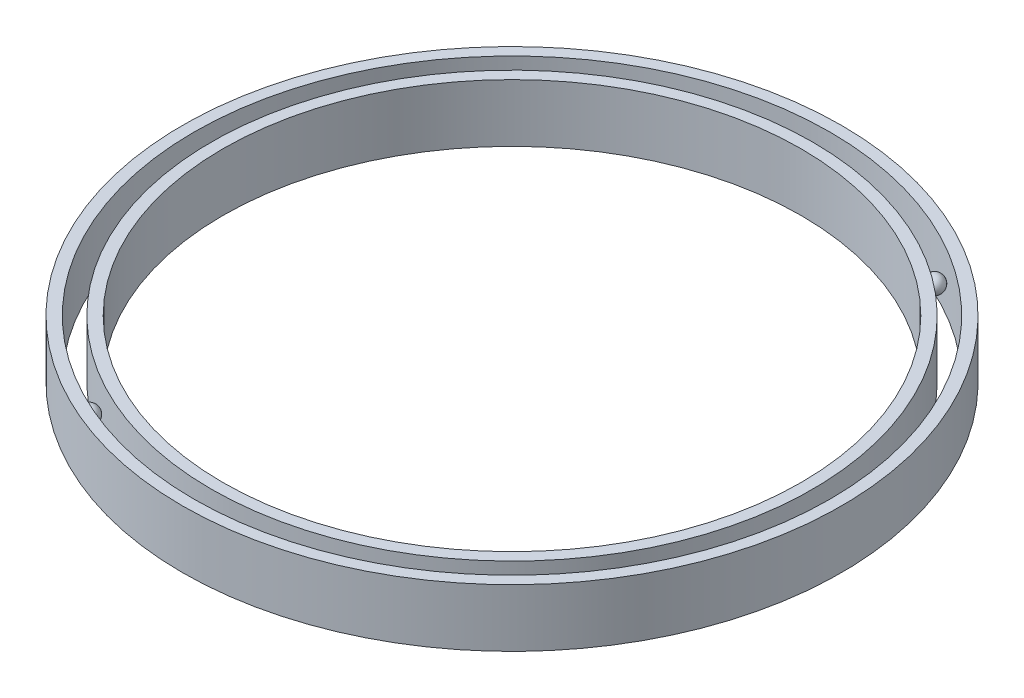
from build123d import *

# Parameters (mm, degrees)
SKETCH1_W         = 4
SKETCH1_H         = 20
SKETCH2_W         = 4
SKETCH2_H         = 20
CIRPATTERN1_COUNT = 6


with BuildPart() as part:
    # Sketch1 → Revolve1 (revolve)
    with BuildSketch(Plane.XY, mode=Mode.PRIVATE) as revolve1_sk:
        with Locations((102, 0)):
            Rectangle(SKETCH1_W, SKETCH1_H)
    revolve(revolve1_sk.sketch.rotate(Axis((0, 0, 0), (0, 1, 0)), 90), axis=Axis((0, 0, 0), (0, 1, 0)))


with BuildPart() as body_2:
    # Sketch2 → Revolve2 (revolve)
    with BuildSketch(Plane.XY, mode=Mode.PRIVATE) as revolve2_sk:
        with Locations((112, 0)):
            Rectangle(SKETCH2_W, SKETCH2_H)
    revolve(revolve2_sk.sketch.rotate(Axis((0, 0, 0), (0, 1, 0)), 90), axis=Axis((0, 0, 0), (0, 1, 0)))


with BuildPart() as body_3:
    # Sketch3 → Revolve3 (revolve)
    with BuildSketch(Plane(origin=(0, 0, 0), x_dir=(1, 0, 0), z_dir=(0, 1, 0))):
        with BuildLine():
            Line((104, 0), (110, 0))
            ThreePointArc((110, 0), (107, 3), (104, 0))
        make_face()
    revolve(axis=Axis((104, 0, 0), (1, 0, 0)))


with BuildPart() as cirpattern1_1:
    # CirPattern1: pattern copy
    add(body_3.part.rotate(Axis((0, 0, 0), (0, 1, 0)), 1 * 360 / CIRPATTERN1_COUNT))


with BuildPart() as cirpattern1_2:
    # CirPattern1: pattern copy
    add(body_3.part.rotate(Axis((0, 0, 0), (0, 1, 0)), 2 * 360 / CIRPATTERN1_COUNT))


with BuildPart() as cirpattern1_3:
    # CirPattern1: pattern copy
    add(body_3.part.rotate(Axis((0, 0, 0), (0, 1, 0)), 3 * 360 / CIRPATTERN1_COUNT))


with BuildPart() as cirpattern1_4:
    # CirPattern1: pattern copy
    add(body_3.part.rotate(Axis((0, 0, 0), (0, 1, 0)), 4 * 360 / CIRPATTERN1_COUNT))


with BuildPart() as cirpattern1_5:
    # CirPattern1: pattern copy
    add(body_3.part.rotate(Axis((0, 0, 0), (0, 1, 0)), 5 * 360 / CIRPATTERN1_COUNT))


solid = Compound([part.part, body_2.part, body_3.part, cirpattern1_1.part, cirpattern1_2.part, cirpattern1_3.part, cirpattern1_4.part, cirpattern1_5.part])
